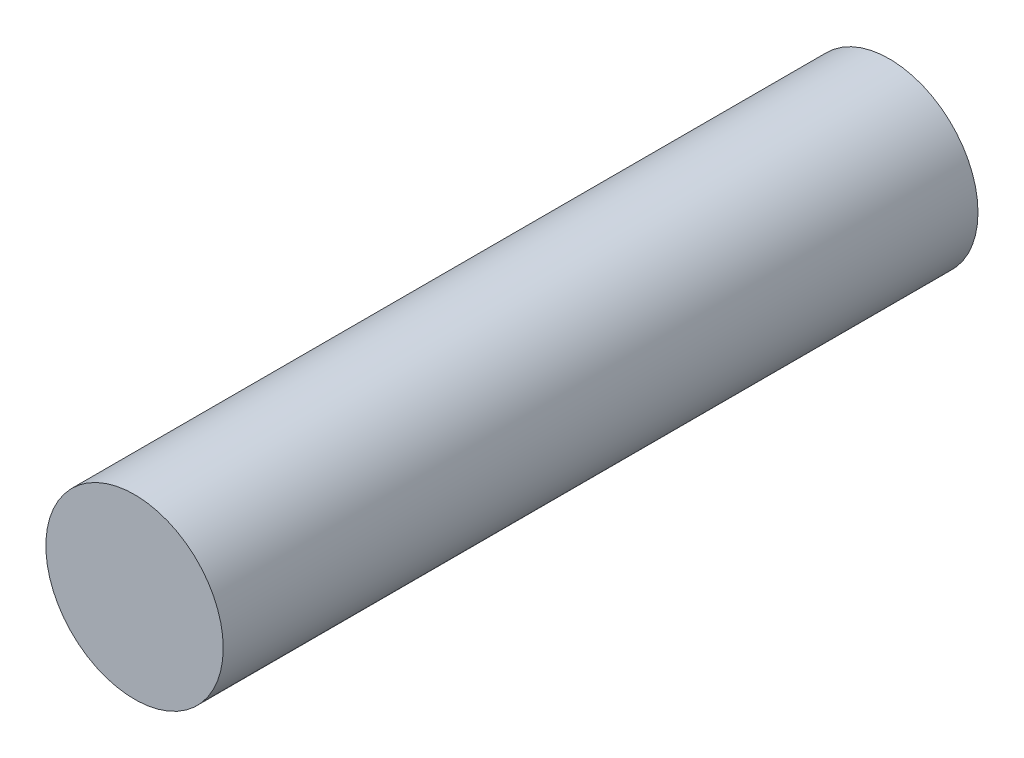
from build123d import *

# Parameters (mm, degrees)
SKETCH1_R      = 1.1938
EXTRUDE1_DEPTH = 5.08


with BuildPart() as part:
    # Sketch1 → Extrude1 (new, symmetric)
    with BuildSketch(Plane.XY):
        Circle(SKETCH1_R)
    extrude(amount=EXTRUDE1_DEPTH, both=True)


solid = part.part
